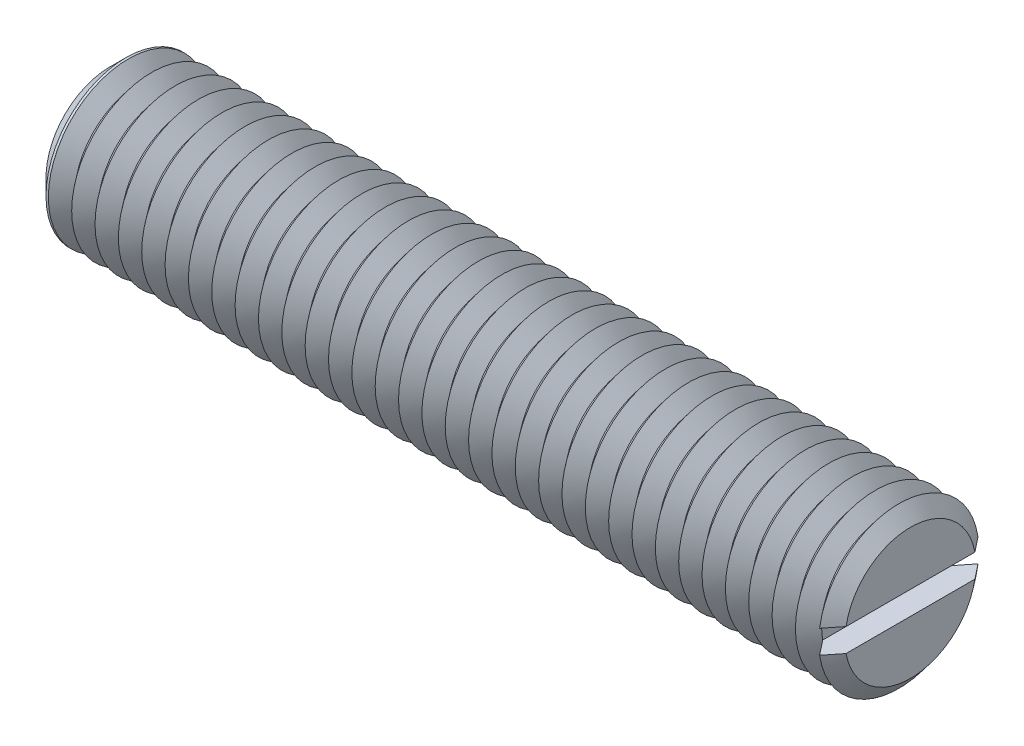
from build123d import *

# Parameters (mm, degrees)
SKETCH1_R       = 6
EXTRUDE1_DEPTH  = 30
SKETCH2_W       = 1.75
SKETCH2_H       = 1.75
EXTRUDE2_DEPTH  = 9
CHAMFER1_SIZE   = 1.2
LPATTERN1_COUNT = 34
LPATTERN1_PITCH = 1.75


with BuildPart() as part:
    # Sketch1 → Extrude1 (new, symmetric)
    with BuildSketch(Plane(origin=(0, 0, 0), x_dir=(0, 0, -1), z_dir=(1, 0, 0))):
        Circle(SKETCH1_R)
    extrude(amount=EXTRUDE1_DEPTH, both=True)

    # Sketch2 → Extrude2 (cut, symmetric)
    with BuildSketch(Plane.XY):
        with Locations((29.125, 0)):
            Rectangle(SKETCH2_W, SKETCH2_H)
    extrude(amount=EXTRUDE2_DEPTH, both=True, mode=Mode.SUBTRACT)

    # Chamfer1
    chamfer1_edges = [part.edges().sort_by_distance(p)[0] for p in [
        (-30, 0, 6),
    ]]
    chamfer(chamfer1_edges, length=CHAMFER1_SIZE)

    # Sketch3 → Cut-Revolve1 (revolve, cut)
    with BuildSketch(Plane.XY, mode=Mode.PRIVATE) as cut_revolve1_sk:
        Polygon((29.125, -6), (30.875, -6), (30, -4.90712535), align=None)
    cut_revolve1 = revolve(cut_revolve1_sk.sketch.rotate(Axis((0, 0, 0), (1, 0, 0)), 261.614461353), axis=Axis((0, 0, 0), (1, 0, 0)), mode=Mode.SUBTRACT)

    # LPattern1: Cut-Revolve1 ×34
    with Locations(*[(-i * LPATTERN1_PITCH, 0, 0) for i in range(1, LPATTERN1_COUNT)]):
        add(cut_revolve1, mode=Mode.SUBTRACT)


solid = part.part
